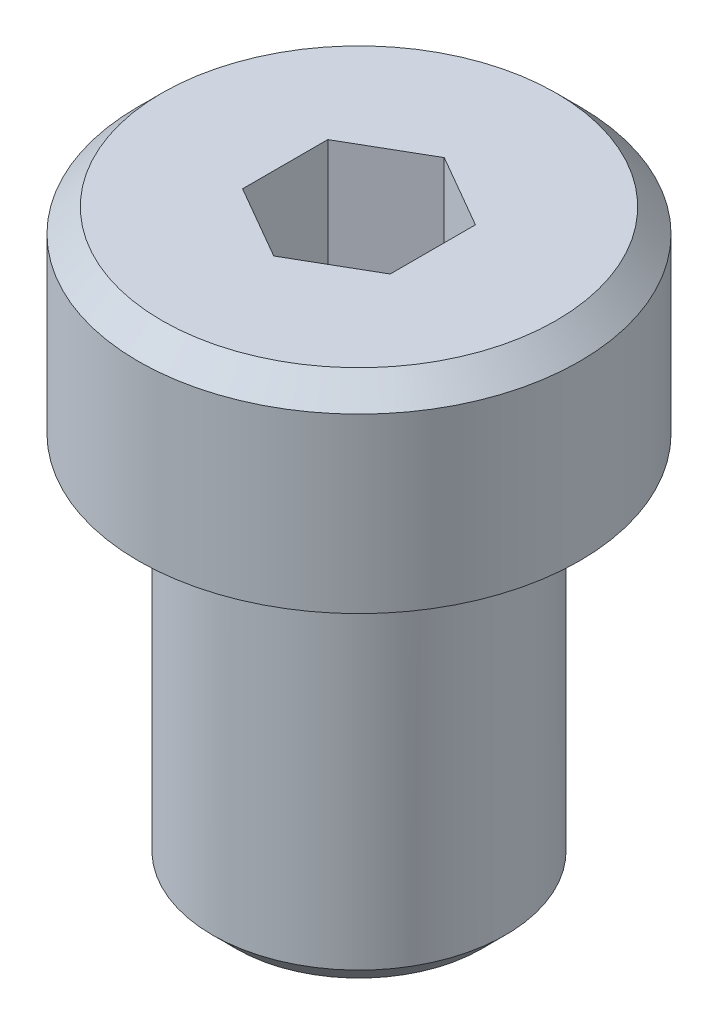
from build123d import *

# Parameters (mm, degrees)
SKETCH3_W          = 4.7371
SKETCH3_H          = 12.446
CUT_EXTRUDE1_DEPTH = 3.581396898
CHAMFER1_SIZE      = 0.762


with BuildPart() as part:
    # Sketch2 → Base-Revolve (revolve)
    with BuildSketch(Plane.XY):
        Polygon((0, 0), (7.137393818, 0), (7.137393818, 5.5879945), (6.375393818, 6.3499945), (0, 6.3499945), align=None)
    revolve(axis=Axis((0, 0, 0), (0, 1, 0)))

    # Sketch3 → Boss-Revolve1 (revolve)
    with BuildSketch(Plane.XY, mode=Mode.PRIVATE) as boss_revolve1_sk:
        with Locations((2.36855, -6.223)):
            Rectangle(SKETCH3_W, SKETCH3_H)
    revolve(boss_revolve1_sk.sketch.rotate(Axis((0, 0, 0), (0, 1, 0)), 90), axis=Axis((0, 0, 0), (0, 1, 0)))

    # Sketch4 → Cut-Extrude1 (cut)
    with BuildSketch(Plane(origin=(0, 6.3499945, 0), x_dir=(-1, 0, 0), z_dir=(0, 1, 0))):
        Polygon((2.387597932, 1.378480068), (6.25e-07, 2.756960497), (-2.387597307, 1.378481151), (-2.387598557, -1.378478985), (-1.876e-06, -2.756960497), (2.387596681, -1.378482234), align=None)
    extrude(amount=-CUT_EXTRUDE1_DEPTH, mode=Mode.SUBTRACT)

    # Chamfer1
    chamfer1_edges = [part.edges().sort_by_distance(p)[0] for p in [
        (0, -12.446, 4.7371),
    ]]
    chamfer(chamfer1_edges, length=CHAMFER1_SIZE)


solid = part.part
